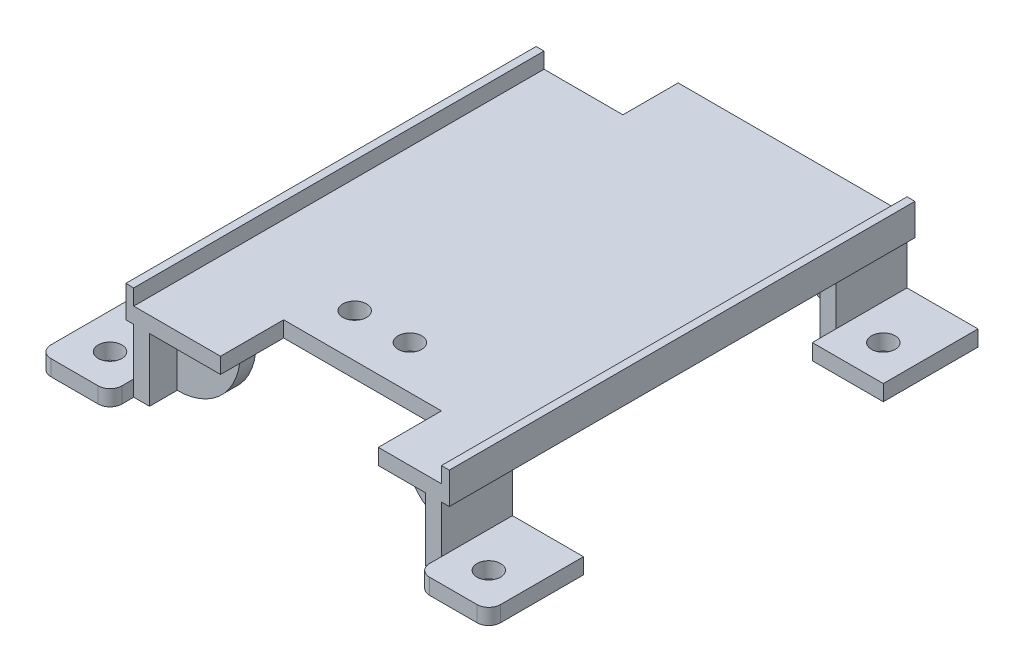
from build123d import *

# Parameters (mm, degrees)
SKETCH1_W           = 57
SKETCH1_H           = 59
BOSS_EXTRUDE1_DEPTH = 10
SKETCH2_W           = 41
SKETCH2_H           = 10
CUT_EXTRUDE1_DEPTH  = 9
SKETCH4_W           = 10
SKETCH4_H           = 7
CUT_EXTRUDE3_DEPTH  = 83.643814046
SKETCH5_W           = 34
SKETCH5_H           = 10
CUT_EXTRUDE4_DEPTH  = 9
SKETCH8_W           = 20
SKETCH8_H           = 10
CUT_EXTRUDE5_DEPTH  = 8
SKETCH9_W           = 35
SKETCH9_H           = 59
CUT_EXTRUDE6_DEPTH  = 8
SKETCH10_W          = 9
SKETCH10_H          = 7
CUT_EXTRUDE7_DEPTH  = 83.643814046
SKETCH11_W          = 9
SKETCH11_H          = 9
CUT_EXTRUDE8_DEPTH  = 8
SKETCH12_W          = 9
SKETCH12_H          = 9
CUT_EXTRUDE9_DEPTH  = 8
SKETCH13_W          = 9
SKETCH13_H          = 9
CUT_EXTRUDE10_DEPTH = 8
SKETCH14_W          = 9
SKETCH14_H          = 9
CUT_EXTRUDE11_DEPTH = 8
SKETCH15_W          = 2
SKETCH15_H          = 41
CUT_EXTRUDE12_DEPTH = 8
SKETCH16_W          = 2
SKETCH16_H          = 34
CUT_EXTRUDE13_DEPTH = 8
SKETCH31_W          = 2
SKETCH31_H          = 8
REVOLVE3_ANGLE      = 90
SKETCH32_W          = 2
SKETCH32_H          = 8
REVOLVE4_ANGLE      = 90
SKETCH33_W          = 6
SKETCH33_H          = 2
REVOLVE5_ANGLE      = 90
SKETCH34_W          = 2
SKETCH34_H          = 8
REVOLVE6_ANGLE      = 90
SKETCH42_R          = 1.5
CUT_EXTRUDE15_DEPTH = 83.643814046
SKETCH46_W          = 59
SKETCH46_H          = 2
BOSS_EXTRUDE3_DEPTH = 1
SKETCH47_W          = 1
SKETCH47_H          = 59
BOSS_EXTRUDE4_DEPTH = 2
SKETCH48_W          = 52
SKETCH48_H          = 2
BOSS_EXTRUDE5_DEPTH = 1
SKETCH49_W          = 1
SKETCH49_H          = 52
BOSS_EXTRUDE6_DEPTH = 2
SKETCH50_W          = 9
SKETCH50_H          = 2
BOSS_EXTRUDE7_DEPTH = 3
SKETCH51_W          = 9
SKETCH51_H          = 2
BOSS_EXTRUDE8_DEPTH = 3
SKETCH52_W          = 9
SKETCH52_H          = 2
BOSS_EXTRUDE9_DEPTH = 3
SKETCH53_R          = 1.5
CUT_EXTRUDE16_DEPTH = 83.643814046
FILLET2_R           = 1.5


with BuildPart() as part:
    # Sketch1 → Boss-Extrude1 (new body)
    with BuildSketch(Plane(origin=(0, 0, 0), x_dir=(1, 0, 0), z_dir=(0, 1, 0))):
        with Locations((28.5, 29.5)):
            Rectangle(SKETCH1_W, SKETCH1_H)
    extrude(amount=BOSS_EXTRUDE1_DEPTH)

    # Sketch2 → Cut-Extrude1 (cut)
    with BuildSketch(Plane(origin=(57, 0, 0), x_dir=(0, 0, -1), z_dir=(1, 0, 0))):
        with Locations((29.5, 5)):
            Rectangle(SKETCH2_W, SKETCH2_H)
    extrude(amount=-CUT_EXTRUDE1_DEPTH, mode=Mode.SUBTRACT)

    # Sketch4 → Cut-Extrude3 (cut, through all)
    with BuildSketch(Plane(origin=(0, 10, 0), x_dir=(1, 0, 0), z_dir=(0, 1, 0))):
        with Locations((5, 55.5)):
            Rectangle(SKETCH4_W, SKETCH4_H)
    extrude(amount=-CUT_EXTRUDE3_DEPTH, mode=Mode.SUBTRACT)

    # Sketch5 → Cut-Extrude4 (cut)
    with BuildSketch(Plane.ZY):
        with Locations((-26, 5)):
            Rectangle(SKETCH5_W, SKETCH5_H)
    extrude(amount=-CUT_EXTRUDE4_DEPTH, mode=Mode.SUBTRACT)

    # Sketch8 → Cut-Extrude5 (cut)
    with BuildSketch(Plane.XY):
        with Locations((30, 5)):
            Rectangle(SKETCH8_W, SKETCH8_H)
    extrude(amount=-CUT_EXTRUDE5_DEPTH, mode=Mode.SUBTRACT)

    # Sketch9 → Cut-Extrude6 (cut)
    with BuildSketch(Plane(origin=(0, 0, 0), x_dir=(-1, 0, 0), z_dir=(0, -1, 0))):
        with Locations((-28.5, 29.5)):
            Rectangle(SKETCH9_W, SKETCH9_H)
    extrude(amount=-CUT_EXTRUDE6_DEPTH, mode=Mode.SUBTRACT)

    # Sketch10 → Cut-Extrude7 (cut, through all)
    with BuildSketch(Plane(origin=(0, 10, 0), x_dir=(1, 0, 0), z_dir=(0, 1, 0))):
        with Locations((14.5, 55.5)):
            Rectangle(SKETCH10_W, SKETCH10_H)
    extrude(amount=-CUT_EXTRUDE7_DEPTH, mode=Mode.SUBTRACT)

    # Sketch11 → Cut-Extrude8 (cut)
    with BuildSketch(Plane(origin=(0, 10, 0), x_dir=(1, 0, 0), z_dir=(0, 1, 0))):
        with Locations((52.5, 4.5)):
            Rectangle(SKETCH11_W, SKETCH11_H)
    extrude(amount=-CUT_EXTRUDE8_DEPTH, mode=Mode.SUBTRACT)

    # Sketch12 → Cut-Extrude9 (cut)
    with BuildSketch(Plane(origin=(0, 10, 0), x_dir=(1, 0, 0), z_dir=(0, 1, 0))):
        with Locations((52.5, 54.5)):
            Rectangle(SKETCH12_W, SKETCH12_H)
    extrude(amount=-CUT_EXTRUDE9_DEPTH, mode=Mode.SUBTRACT)

    # Sketch13 → Cut-Extrude10 (cut)
    with BuildSketch(Plane(origin=(0, 10, 0), x_dir=(1, 0, 0), z_dir=(0, 1, 0))):
        with Locations((4.5, 47.5)):
            Rectangle(SKETCH13_W, SKETCH13_H)
    extrude(amount=-CUT_EXTRUDE10_DEPTH, mode=Mode.SUBTRACT)

    # Sketch14 → Cut-Extrude11 (cut)
    with BuildSketch(Plane(origin=(0, 10, 0), x_dir=(1, 0, 0), z_dir=(0, 1, 0))):
        with Locations((4.5, 4.5)):
            Rectangle(SKETCH14_W, SKETCH14_H)
    extrude(amount=-CUT_EXTRUDE11_DEPTH, mode=Mode.SUBTRACT)

    # Sketch15 → Cut-Extrude12 (cut)
    with BuildSketch(Plane(origin=(0, 0, 0), x_dir=(-1, 0, 0), z_dir=(0, -1, 0))):
        with Locations((-47, 29.5)):
            Rectangle(SKETCH15_W, SKETCH15_H)
    extrude(amount=-CUT_EXTRUDE12_DEPTH, mode=Mode.SUBTRACT)

    # Sketch16 → Cut-Extrude13 (cut)
    with BuildSketch(Plane(origin=(0, 0, 0), x_dir=(-1, 0, 0), z_dir=(0, -1, 0))):
        with Locations((-10, 26)):
            Rectangle(SKETCH16_W, SKETCH16_H)
    extrude(amount=-CUT_EXTRUDE13_DEPTH, mode=Mode.SUBTRACT)

    # Sketch31 → Revolve3 (revolve)
    with BuildSketch(Plane(origin=(11, 0, 0), x_dir=(0, 0, -1), z_dir=(1, 0, 0))):
        with Locations((4.5, 4)):
            Rectangle(SKETCH31_W, SKETCH31_H)
    revolve(axis=Axis((11, 8, -3.5), (0, 0, 1)), revolution_arc=REVOLVE3_ANGLE)

    # Sketch32 → Revolve4 (revolve)
    with BuildSketch(Plane(origin=(11, 0, 0), x_dir=(0, 0, -1), z_dir=(1, 0, 0))):
        with Locations((47.5, 4)):
            Rectangle(SKETCH32_W, SKETCH32_H)
    revolve(axis=Axis((11, 8, -46.5), (0, 0, 1)), revolution_arc=REVOLVE4_ANGLE)

    # Sketch33 → Revolve5 (revolve)
    with BuildSketch(Plane.XZ.offset(-8)):
        with Locations((43, -4.5)):
            Rectangle(SKETCH33_W, SKETCH33_H)
    revolve(axis=Axis((46, 8, -3.5), (0, 0, 1)), revolution_arc=REVOLVE5_ANGLE)

    # Sketch34 → Revolve6 (revolve)
    with BuildSketch(Plane.ZY.offset(-46)):
        with Locations((-54.5, 4)):
            Rectangle(SKETCH34_W, SKETCH34_H)
    revolve(axis=Axis((46, 8, -53.5), (0, 0, -1)), revolution_arc=REVOLVE6_ANGLE)

    # Sketch42 → Cut-Extrude15 (cut, through all)
    with BuildSketch(Plane(origin=(0, 10, 0), x_dir=(1, 0, 0), z_dir=(0, 1, 0))):
        with Locations(Location((23.5, 13.5, 0), (0, 0, 270))):
            Circle(SKETCH42_R)
        with Locations(Location((30.5, 13.5, 0), (0, 0, 270))):
            Circle(SKETCH42_R)
    extrude(amount=-CUT_EXTRUDE15_DEPTH, mode=Mode.SUBTRACT)

    # Sketch46 → Boss-Extrude3 (add)
    with BuildSketch(Plane(origin=(48, 0, 0), x_dir=(0, 0, -1), z_dir=(1, 0, 0))):
        with Locations((29.5, 9)):
            Rectangle(SKETCH46_W, SKETCH46_H)
    extrude(amount=BOSS_EXTRUDE3_DEPTH)

    # Sketch47 → Boss-Extrude4 (add)
    with BuildSketch(Plane(origin=(0, 10, 0), x_dir=(1, 0, 0), z_dir=(0, 1, 0))):
        with Locations((48.5, 29.5)):
            Rectangle(SKETCH47_W, SKETCH47_H)
    extrude(amount=BOSS_EXTRUDE4_DEPTH)

    # Sketch48 → Boss-Extrude5 (add)
    with BuildSketch(Plane.ZY.offset(-9)):
        with Locations((-26, 9)):
            Rectangle(SKETCH48_W, SKETCH48_H)
    extrude(amount=BOSS_EXTRUDE5_DEPTH)

    # Sketch49 → Boss-Extrude6 (add)
    with BuildSketch(Plane(origin=(0, 10, 0), x_dir=(1, 0, 0), z_dir=(0, 1, 0))):
        with Locations((8.5, 26)):
            Rectangle(SKETCH49_W, SKETCH49_H)
    extrude(amount=BOSS_EXTRUDE6_DEPTH)

    # Sketch50 → Boss-Extrude7 (add)
    with BuildSketch(Plane.XY):
        with Locations((4.5, 1)):
            Rectangle(SKETCH50_W, SKETCH50_H)
        with Locations((52.5, 1)):
            Rectangle(SKETCH50_W, SKETCH50_H)
    extrude(amount=BOSS_EXTRUDE7_DEPTH)

    # Sketch51 → Boss-Extrude8 (add)
    with BuildSketch(Plane.XY.offset(-43)):
        with Locations((4.5, 1)):
            Rectangle(SKETCH51_W, SKETCH51_H)
    extrude(amount=BOSS_EXTRUDE8_DEPTH)

    # Sketch52 → Boss-Extrude9 (add)
    with BuildSketch(Plane.XY.offset(-50)):
        with Locations((52.5, 1)):
            Rectangle(SKETCH52_W, SKETCH52_H)
    extrude(amount=BOSS_EXTRUDE9_DEPTH)

    # Sketch53 → Cut-Extrude16 (cut, through all)
    with BuildSketch(Plane(origin=(0, 2, 0), x_dir=(1, 0, 0), z_dir=(0, 1, 0))):
        with Locations(Location((4.5, 44.5, 0), (0, 0, 270))):
            Circle(SKETCH53_R)
        with Locations(Location((52.5, 51.5, 0), (0, 0, 270))):
            Circle(SKETCH53_R)
        with Locations(Location((52.5, 1.5, 0), (0, 0, 270))):
            Circle(SKETCH53_R)
        with Locations(Location((4.5, 1.5, 0), (0, 0, 270))):
            Circle(SKETCH53_R)
    extrude(amount=-CUT_EXTRUDE16_DEPTH, mode=Mode.SUBTRACT)

    # Fillet2
    fillet2_edges = [part.edges().sort_by_distance(p)[0] for p in [
        (0, 1, 3),
        (9, 1, 3),
        (48, 1, 3),
        (57, 1, 3),
    ]]
    fillet(fillet2_edges, radius=FILLET2_R)


solid = part.part
